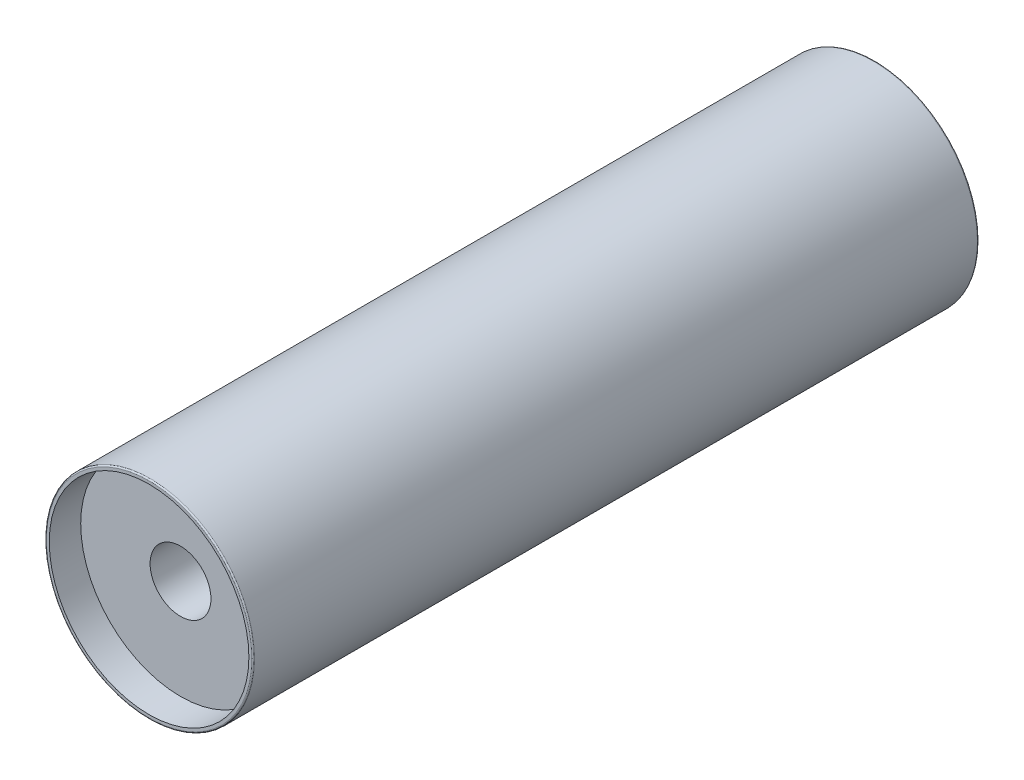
ISO-10303-21;
HEADER;
FILE_DESCRIPTION(('STEP AP214'),'2;1');
FILE_NAME('part.step','',(''),(''),'','','');
FILE_SCHEMA(('AUTOMOTIVE_DESIGN { 1 0 10303 214 1 1 1 1 }'));
ENDSEC;
DATA;
#1=APPLICATION_CONTEXT('core data for automotive mechanical design processes');
#2=APPLICATION_PROTOCOL_DEFINITION('international standard','automotive_design',2000,#1);
#3=PRODUCT_CONTEXT('',#1,'mechanical');
#4=PRODUCT('Part','Part','',(#3));
#5=PRODUCT_RELATED_PRODUCT_CATEGORY('part','',(#4));
#6=PRODUCT_DEFINITION_FORMATION('','',#4);
#7=PRODUCT_DEFINITION_CONTEXT('part definition',#1,'design');
#8=PRODUCT_DEFINITION('design','',#6,#7);
#9=PRODUCT_DEFINITION_SHAPE('','',#8);
#10=(LENGTH_UNIT() NAMED_UNIT(*) SI_UNIT(.MILLI.,.METRE.));
#11=(NAMED_UNIT(*) PLANE_ANGLE_UNIT() SI_UNIT($,.RADIAN.));
#12=(NAMED_UNIT(*) SI_UNIT($,.STERADIAN.) SOLID_ANGLE_UNIT());
#13=UNCERTAINTY_MEASURE_WITH_UNIT(LENGTH_MEASURE(1.E-05),#10,'distance_accuracy_value','');
#14=(GEOMETRIC_REPRESENTATION_CONTEXT(3) GLOBAL_UNCERTAINTY_ASSIGNED_CONTEXT((#13)) GLOBAL_UNIT_ASSIGNED_CONTEXT((#10,
#11,#12)) REPRESENTATION_CONTEXT('',''));
#15=CARTESIAN_POINT('',(0.,0.,0.));
#16=DIRECTION('',(0.,0.,1.));
#17=DIRECTION('',(1.,0.,0.));
#18=AXIS2_PLACEMENT_3D('',#15,#16,#17);
#19=CARTESIAN_POINT('',(0.,0.,-69.25));
#20=DIRECTION('',(0.,0.,1.));
#21=DIRECTION('',(1.,0.,0.));
#22=AXIS2_PLACEMENT_3D('',#19,#20,#21);
#23=CYLINDRICAL_SURFACE('',#22,5.80625);
#24=CARTESIAN_POINT('',(0.,0.,-40.6));
#25=DIRECTION('',(0.,0.,1.));
#26=DIRECTION('',(1.,0.,0.));
#27=AXIS2_PLACEMENT_3D('',#24,#25,#26);
#28=CIRCLE('',#27,5.80625);
#29=CARTESIAN_POINT('',(5.80625,0.,-40.6));
#30=VERTEX_POINT('',#29);
#31=EDGE_CURVE('E48',#30,#30,#28,.T.);
#32=ORIENTED_EDGE('',*,*,#31,.T.);
#33=EDGE_LOOP('',(#32));
#34=FACE_BOUND('',#33,.T.);
#35=CARTESIAN_POINT('',(0.,0.,-63.25));
#36=DIRECTION('',(0.,0.,-1.));
#37=DIRECTION('',(-1.,0.,0.));
#38=AXIS2_PLACEMENT_3D('',#35,#36,#37);
#39=CIRCLE('',#38,5.80625);
#40=CARTESIAN_POINT('',(-5.80625,0.,-63.25));
#41=VERTEX_POINT('',#40);
#42=EDGE_CURVE('E34',#41,#41,#39,.F.);
#43=ORIENTED_EDGE('',*,*,#42,.F.);
#44=EDGE_LOOP('',(#43));
#45=FACE_BOUND('',#44,.T.);
#46=ADVANCED_FACE('F30',(#34,#45),#23,.F.);
#47=CARTESIAN_POINT('',(0.,0.,-69.25));
#48=DIRECTION('',(0.,0.,1.));
#49=DIRECTION('',(1.,0.,0.));
#50=AXIS2_PLACEMENT_3D('',#47,#48,#49);
#51=PLANE('',#50);
#52=CARTESIAN_POINT('',(0.,0.,-69.25));
#53=DIRECTION('',(0.,0.,1.));
#54=DIRECTION('',(1.,0.,0.));
#55=AXIS2_PLACEMENT_3D('',#52,#53,#54);
#56=CIRCLE('',#55,19.6);
#57=CARTESIAN_POINT('',(19.6,0.,-69.25));
#58=VERTEX_POINT('',#57);
#59=EDGE_CURVE('E11',#58,#58,#56,.F.);
#60=ORIENTED_EDGE('',*,*,#59,.T.);
#61=EDGE_LOOP('',(#60));
#62=FACE_BOUND('',#61,.T.);
#63=CARTESIAN_POINT('',(0.,0.,-69.25));
#64=DIRECTION('',(0.,0.,1.));
#65=DIRECTION('',(1.,0.,0.));
#66=AXIS2_PLACEMENT_3D('',#63,#64,#65);
#67=CIRCLE('',#66,19.05);
#68=CARTESIAN_POINT('',(19.05,0.,-69.25));
#69=VERTEX_POINT('',#68);
#70=EDGE_CURVE('E163',#69,#69,#67,.T.);
#71=ORIENTED_EDGE('',*,*,#70,.T.);
#72=EDGE_LOOP('',(#71));
#73=FACE_BOUND('',#72,.T.);
#74=ADVANCED_FACE('F96',(#62,#73),#51,.F.);
#75=CARTESIAN_POINT('',(0.,0.,40.6));
#76=DIRECTION('',(0.,0.,1.));
#77=DIRECTION('',(1.,0.,0.));
#78=AXIS2_PLACEMENT_3D('',#75,#76,#77);
#79=CIRCLE('',#78,5.80625);
#80=CARTESIAN_POINT('',(5.80625,0.,40.6));
#81=VERTEX_POINT('',#80);
#82=EDGE_CURVE('E53',#81,#81,#79,.T.);
#83=ORIENTED_EDGE('',*,*,#82,.F.);
#84=EDGE_LOOP('',(#83));
#85=FACE_BOUND('',#84,.T.);
#86=CARTESIAN_POINT('',(0.,0.,63.25));
#87=DIRECTION('',(0.,0.,1.));
#88=DIRECTION('',(1.,0.,0.));
#89=AXIS2_PLACEMENT_3D('',#86,#87,#88);
#90=CIRCLE('',#89,5.80625);
#91=CARTESIAN_POINT('',(5.80625,0.,63.25));
#92=VERTEX_POINT('',#91);
#93=EDGE_CURVE('E46',#92,#92,#90,.F.);
#94=ORIENTED_EDGE('',*,*,#93,.F.);
#95=EDGE_LOOP('',(#94));
#96=FACE_BOUND('',#95,.T.);
#97=ADVANCED_FACE('F99',(#85,#96),#23,.F.);
#98=CARTESIAN_POINT('',(0.,0.,40.6));
#99=DIRECTION('',(0.,0.,-1.));
#100=DIRECTION('',(-1.,0.,0.));
#101=AXIS2_PLACEMENT_3D('',#98,#99,#100);
#102=CYLINDRICAL_SURFACE('',#101,19.05);
#103=CARTESIAN_POINT('',(0.,0.,40.6));
#104=DIRECTION('',(0.,0.,1.));
#105=DIRECTION('',(1.,0.,0.));
#106=AXIS2_PLACEMENT_3D('',#103,#104,#105);
#107=CIRCLE('',#106,19.05);
#108=CARTESIAN_POINT('',(19.05,0.,40.6));
#109=VERTEX_POINT('',#108);
#110=EDGE_CURVE('E69',#109,#109,#107,.T.);
#111=ORIENTED_EDGE('',*,*,#110,.T.);
#112=EDGE_LOOP('',(#111));
#113=FACE_BOUND('',#112,.T.);
#114=CARTESIAN_POINT('',(0.,0.,-40.6));
#115=DIRECTION('',(0.,0.,1.));
#116=DIRECTION('',(1.,0.,0.));
#117=AXIS2_PLACEMENT_3D('',#114,#115,#116);
#118=CIRCLE('',#117,19.05);
#119=CARTESIAN_POINT('',(19.05,0.,-40.6));
#120=VERTEX_POINT('',#119);
#121=EDGE_CURVE('E66',#120,#120,#118,.T.);
#122=ORIENTED_EDGE('',*,*,#121,.F.);
#123=EDGE_LOOP('',(#122));
#124=FACE_BOUND('',#123,.T.);
#125=ADVANCED_FACE('F108',(#113,#124),#102,.F.);
#126=CARTESIAN_POINT('',(0.,0.,40.6));
#127=DIRECTION('',(0.,0.,1.));
#128=DIRECTION('',(1.,0.,0.));
#129=AXIS2_PLACEMENT_3D('',#126,#127,#128);
#130=PLANE('',#129);
#131=ORIENTED_EDGE('',*,*,#82,.T.);
#132=EDGE_LOOP('',(#131));
#133=FACE_BOUND('',#132,.T.);
#134=ORIENTED_EDGE('',*,*,#110,.F.);
#135=EDGE_LOOP('',(#134));
#136=FACE_BOUND('',#135,.T.);
#137=ADVANCED_FACE('F114',(#133,#136),#130,.F.);
#138=CARTESIAN_POINT('',(0.,0.,-40.6));
#139=DIRECTION('',(0.,0.,1.));
#140=DIRECTION('',(1.,0.,0.));
#141=AXIS2_PLACEMENT_3D('',#138,#139,#140);
#142=PLANE('',#141);
#143=ORIENTED_EDGE('',*,*,#31,.F.);
#144=EDGE_LOOP('',(#143));
#145=FACE_BOUND('',#144,.T.);
#146=ORIENTED_EDGE('',*,*,#121,.T.);
#147=EDGE_LOOP('',(#146));
#148=FACE_BOUND('',#147,.T.);
#149=ADVANCED_FACE('F122',(#145,#148),#142,.T.);
#150=CARTESIAN_POINT('',(0.,0.,69.25));
#151=DIRECTION('',(0.,0.,-1.));
#152=DIRECTION('',(-1.,0.,0.));
#153=AXIS2_PLACEMENT_3D('',#150,#151,#152);
#154=CYLINDRICAL_SURFACE('',#153,19.85);
#155=CARTESIAN_POINT('',(0.,0.,69.));
#156=DIRECTION('',(0.,0.,1.));
#157=DIRECTION('',(1.,0.,0.));
#158=AXIS2_PLACEMENT_3D('',#155,#156,#157);
#159=CIRCLE('',#158,19.85);
#160=CARTESIAN_POINT('',(19.85,0.,69.));
#161=VERTEX_POINT('',#160);
#162=EDGE_CURVE('E38',#161,#161,#159,.F.);
#163=ORIENTED_EDGE('',*,*,#162,.T.);
#164=EDGE_LOOP('',(#163));
#165=FACE_BOUND('',#164,.T.);
#166=CARTESIAN_POINT('',(0.,0.,-69.));
#167=DIRECTION('',(0.,0.,1.));
#168=DIRECTION('',(1.,0.,0.));
#169=AXIS2_PLACEMENT_3D('',#166,#167,#168);
#170=CIRCLE('',#169,19.85);
#171=CARTESIAN_POINT('',(19.85,0.,-69.));
#172=VERTEX_POINT('',#171);
#173=EDGE_CURVE('E43',#172,#172,#170,.T.);
#174=ORIENTED_EDGE('',*,*,#173,.T.);
#175=EDGE_LOOP('',(#174));
#176=FACE_BOUND('',#175,.T.);
#177=ADVANCED_FACE('F32',(#165,#176),#154,.T.);
#178=CARTESIAN_POINT('',(0.,0.,69.25));
#179=DIRECTION('',(0.,0.,1.));
#180=DIRECTION('',(1.,0.,0.));
#181=AXIS2_PLACEMENT_3D('',#178,#179,#180);
#182=PLANE('',#181);
#183=CARTESIAN_POINT('',(0.,0.,69.25));
#184=DIRECTION('',(0.,0.,1.));
#185=DIRECTION('',(1.,0.,0.));
#186=AXIS2_PLACEMENT_3D('',#183,#184,#185);
#187=CIRCLE('',#186,19.05);
#188=CARTESIAN_POINT('',(19.05,0.,69.25));
#189=VERTEX_POINT('',#188);
#190=EDGE_CURVE('E56',#189,#189,#187,.T.);
#191=ORIENTED_EDGE('',*,*,#190,.F.);
#192=EDGE_LOOP('',(#191));
#193=FACE_BOUND('',#192,.T.);
#194=CARTESIAN_POINT('',(0.,0.,69.25));
#195=DIRECTION('',(0.,0.,1.));
#196=DIRECTION('',(1.,0.,0.));
#197=AXIS2_PLACEMENT_3D('',#194,#195,#196);
#198=CIRCLE('',#197,19.6);
#199=CARTESIAN_POINT('',(19.6,0.,69.25));
#200=VERTEX_POINT('',#199);
#201=EDGE_CURVE('E71',#200,#200,#198,.T.);
#202=ORIENTED_EDGE('',*,*,#201,.T.);
#203=EDGE_LOOP('',(#202));
#204=FACE_BOUND('',#203,.T.);
#205=ADVANCED_FACE('F91',(#193,#204),#182,.T.);
#206=CARTESIAN_POINT('',(0.,0.,69.));
#207=DIRECTION('',(0.,0.,1.));
#208=DIRECTION('',(1.,0.,0.));
#209=AXIS2_PLACEMENT_3D('',#206,#207,#208);
#210=TOROIDAL_SURFACE('',#209,19.6,0.25);
#211=ORIENTED_EDGE('',*,*,#162,.F.);
#212=EDGE_LOOP('',(#211));
#213=FACE_BOUND('',#212,.T.);
#214=ORIENTED_EDGE('',*,*,#201,.F.);
#215=EDGE_LOOP('',(#214));
#216=FACE_BOUND('',#215,.T.);
#217=ADVANCED_FACE('F81',(#213,#216),#210,.T.);
#218=CARTESIAN_POINT('',(0.,0.,-69.));
#219=DIRECTION('',(0.,0.,1.));
#220=DIRECTION('',(1.,0.,0.));
#221=AXIS2_PLACEMENT_3D('',#218,#219,#220);
#222=TOROIDAL_SURFACE('',#221,19.6,0.25);
#223=ORIENTED_EDGE('',*,*,#59,.F.);
#224=EDGE_LOOP('',(#223));
#225=FACE_BOUND('',#224,.T.);
#226=ORIENTED_EDGE('',*,*,#173,.F.);
#227=EDGE_LOOP('',(#226));
#228=FACE_BOUND('',#227,.T.);
#229=ADVANCED_FACE('F78',(#225,#228),#222,.T.);
#230=CARTESIAN_POINT('',(0.,0.,63.25));
#231=DIRECTION('',(0.,0.,1.));
#232=DIRECTION('',(1.,0.,0.));
#233=AXIS2_PLACEMENT_3D('',#230,#231,#232);
#234=PLANE('',#233);
#235=CARTESIAN_POINT('',(0.,0.,63.25));
#236=DIRECTION('',(0.,0.,1.));
#237=DIRECTION('',(1.,0.,0.));
#238=AXIS2_PLACEMENT_3D('',#235,#236,#237);
#239=CIRCLE('',#238,19.05);
#240=CARTESIAN_POINT('',(19.05,0.,63.25));
#241=VERTEX_POINT('',#240);
#242=EDGE_CURVE('E49',#241,#241,#239,.T.);
#243=ORIENTED_EDGE('',*,*,#242,.T.);
#244=EDGE_LOOP('',(#243));
#245=FACE_BOUND('',#244,.T.);
#246=ORIENTED_EDGE('',*,*,#93,.T.);
#247=EDGE_LOOP('',(#246));
#248=FACE_BOUND('',#247,.T.);
#249=ADVANCED_FACE('F80',(#245,#248),#234,.T.);
#250=CARTESIAN_POINT('',(0.,0.,63.25));
#251=DIRECTION('',(0.,0.,1.));
#252=DIRECTION('',(1.,0.,0.));
#253=AXIS2_PLACEMENT_3D('',#250,#251,#252);
#254=CYLINDRICAL_SURFACE('',#253,19.05);
#255=ORIENTED_EDGE('',*,*,#242,.F.);
#256=EDGE_LOOP('',(#255));
#257=FACE_BOUND('',#256,.T.);
#258=ORIENTED_EDGE('',*,*,#190,.T.);
#259=EDGE_LOOP('',(#258));
#260=FACE_BOUND('',#259,.T.);
#261=ADVANCED_FACE('F89',(#257,#260),#254,.F.);
#262=CARTESIAN_POINT('',(0.,0.,-63.25));
#263=DIRECTION('',(0.,0.,-1.));
#264=DIRECTION('',(1.,0.,0.));
#265=AXIS2_PLACEMENT_3D('',#262,#263,#264);
#266=PLANE('',#265);
#267=CARTESIAN_POINT('',(0.,0.,-63.25));
#268=DIRECTION('',(0.,0.,1.));
#269=DIRECTION('',(1.,0.,0.));
#270=AXIS2_PLACEMENT_3D('',#267,#268,#269);
#271=CIRCLE('',#270,19.05);
#272=CARTESIAN_POINT('',(19.05,0.,-63.25));
#273=VERTEX_POINT('',#272);
#274=EDGE_CURVE('E160',#273,#273,#271,.T.);
#275=ORIENTED_EDGE('',*,*,#274,.F.);
#276=EDGE_LOOP('',(#275));
#277=FACE_BOUND('',#276,.T.);
#278=ORIENTED_EDGE('',*,*,#42,.T.);
#279=EDGE_LOOP('',(#278));
#280=FACE_BOUND('',#279,.T.);
#281=ADVANCED_FACE('F144',(#277,#280),#266,.T.);
#282=CARTESIAN_POINT('',(0.,0.,-63.25));
#283=DIRECTION('',(0.,0.,-1.));
#284=DIRECTION('',(-1.,0.,0.));
#285=AXIS2_PLACEMENT_3D('',#282,#283,#284);
#286=CYLINDRICAL_SURFACE('',#285,19.05);
#287=ORIENTED_EDGE('',*,*,#274,.T.);
#288=EDGE_LOOP('',(#287));
#289=FACE_BOUND('',#288,.T.);
#290=ORIENTED_EDGE('',*,*,#70,.F.);
#291=EDGE_LOOP('',(#290));
#292=FACE_BOUND('',#291,.T.);
#293=ADVANCED_FACE('F149',(#289,#292),#286,.F.);
#294=CLOSED_SHELL('',(#46,#74,#97,#125,#137,#149,#177,#205,#217,#229,#249,#261,#281,#293));
#295=MANIFOLD_SOLID_BREP('B2',#294);
#296=ADVANCED_BREP_SHAPE_REPRESENTATION('',(#18,#295),#14);
#297=SHAPE_DEFINITION_REPRESENTATION(#9,#296);
ENDSEC;
END-ISO-10303-21;
